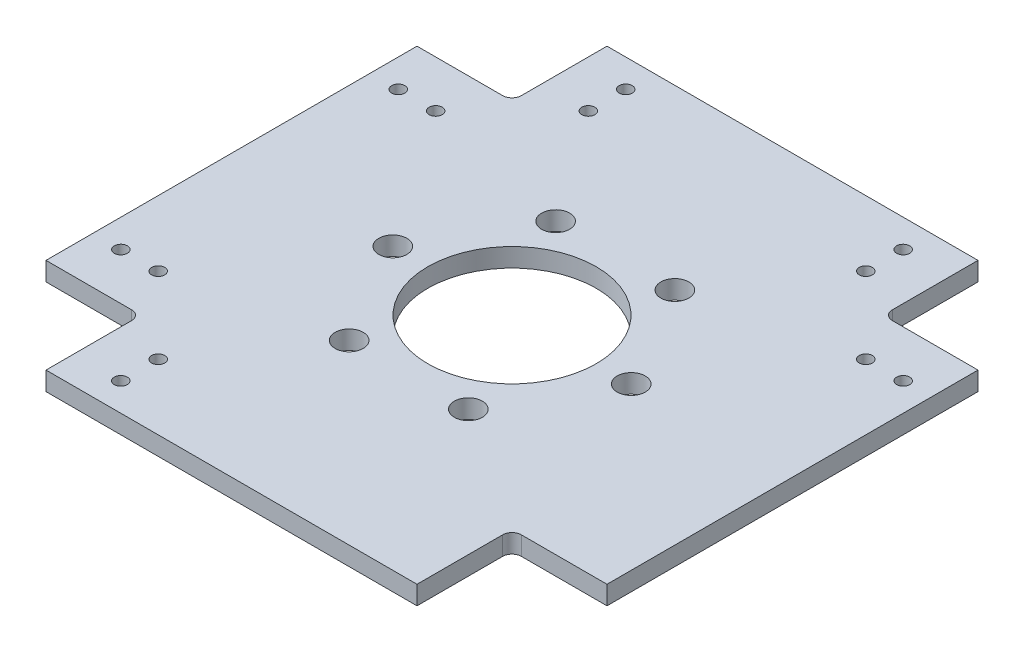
ISO-10303-21;
HEADER;
FILE_DESCRIPTION(('STEP AP214'),'2;1');
FILE_NAME('part.step','',(''),(''),'','','');
FILE_SCHEMA(('AUTOMOTIVE_DESIGN { 1 0 10303 214 1 1 1 1 }'));
ENDSEC;
DATA;
#1=APPLICATION_CONTEXT('core data for automotive mechanical design processes');
#2=APPLICATION_PROTOCOL_DEFINITION('international standard','automotive_design',2000,#1);
#3=PRODUCT_CONTEXT('',#1,'mechanical');
#4=PRODUCT('Part','Part','',(#3));
#5=PRODUCT_RELATED_PRODUCT_CATEGORY('part','',(#4));
#6=PRODUCT_DEFINITION_FORMATION('','',#4);
#7=PRODUCT_DEFINITION_CONTEXT('part definition',#1,'design');
#8=PRODUCT_DEFINITION('design','',#6,#7);
#9=PRODUCT_DEFINITION_SHAPE('','',#8);
#10=(LENGTH_UNIT() NAMED_UNIT(*) SI_UNIT(.MILLI.,.METRE.));
#11=(NAMED_UNIT(*) PLANE_ANGLE_UNIT() SI_UNIT($,.RADIAN.));
#12=(NAMED_UNIT(*) SI_UNIT($,.STERADIAN.) SOLID_ANGLE_UNIT());
#13=UNCERTAINTY_MEASURE_WITH_UNIT(LENGTH_MEASURE(1.E-05),#10,'distance_accuracy_value','');
#14=(GEOMETRIC_REPRESENTATION_CONTEXT(3) GLOBAL_UNCERTAINTY_ASSIGNED_CONTEXT((#13)) GLOBAL_UNIT_ASSIGNED_CONTEXT((#10,
#11,#12)) REPRESENTATION_CONTEXT('',''));
#15=CARTESIAN_POINT('',(0.,0.,0.));
#16=DIRECTION('',(0.,0.,1.));
#17=DIRECTION('',(1.,0.,0.));
#18=AXIS2_PLACEMENT_3D('',#15,#16,#17);
#19=CARTESIAN_POINT('',(0.,10.,0.));
#20=DIRECTION('',(0.,-1.,0.));
#21=DIRECTION('',(0.,0.,-1.));
#22=AXIS2_PLACEMENT_3D('',#19,#20,#21);
#23=PLANE('',#22);
#24=CARTESIAN_POINT('',(-63.75,10.,0.));
#25=DIRECTION('',(0.,-1.,0.));
#26=DIRECTION('',(0.,0.,-1.));
#27=AXIS2_PLACEMENT_3D('',#24,#25,#26);
#28=CIRCLE('',#27,7.49999999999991);
#29=CARTESIAN_POINT('',(-63.75,10.,-7.4999999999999));
#30=VERTEX_POINT('',#29);
#31=EDGE_CURVE('E795',#30,#30,#28,.T.);
#32=ORIENTED_EDGE('',*,*,#31,.T.);
#33=EDGE_LOOP('',(#32));
#34=FACE_BOUND('',#33,.T.);
#35=CARTESIAN_POINT('',(-31.8749999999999,10.,55.2091194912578));
#36=DIRECTION('',(0.,-1.,0.));
#37=DIRECTION('',(0.,0.,-1.));
#38=AXIS2_PLACEMENT_3D('',#35,#36,#37);
#39=CIRCLE('',#38,7.49999999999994);
#40=CARTESIAN_POINT('',(-31.8749999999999,10.,47.7091194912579));
#41=VERTEX_POINT('',#40);
#42=EDGE_CURVE('E921',#41,#41,#39,.T.);
#43=ORIENTED_EDGE('',*,*,#42,.T.);
#44=EDGE_LOOP('',(#43));
#45=FACE_BOUND('',#44,.T.);
#46=CARTESIAN_POINT('',(31.8750000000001,10.,55.2091194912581));
#47=DIRECTION('',(0.,-1.,0.));
#48=DIRECTION('',(0.,0.,-1.));
#49=AXIS2_PLACEMENT_3D('',#46,#47,#48);
#50=CIRCLE('',#49,7.50000000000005);
#51=CARTESIAN_POINT('',(31.8750000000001,10.,47.709119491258));
#52=VERTEX_POINT('',#51);
#53=EDGE_CURVE('E915',#52,#52,#50,.T.);
#54=ORIENTED_EDGE('',*,*,#53,.T.);
#55=EDGE_LOOP('',(#54));
#56=FACE_BOUND('',#55,.T.);
#57=CARTESIAN_POINT('',(63.7500000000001,10.,0.));
#58=DIRECTION('',(0.,-1.,0.));
#59=DIRECTION('',(0.,0.,-1.));
#60=AXIS2_PLACEMENT_3D('',#57,#58,#59);
#61=CIRCLE('',#60,7.5);
#62=CARTESIAN_POINT('',(63.7500000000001,10.,-7.50000000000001));
#63=VERTEX_POINT('',#62);
#64=EDGE_CURVE('E907',#63,#63,#61,.T.);
#65=ORIENTED_EDGE('',*,*,#64,.T.);
#66=EDGE_LOOP('',(#65));
#67=FACE_BOUND('',#66,.T.);
#68=CARTESIAN_POINT('',(31.875,10.,-55.2091194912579));
#69=DIRECTION('',(0.,-1.,0.));
#70=DIRECTION('',(0.,0.,-1.));
#71=AXIS2_PLACEMENT_3D('',#68,#69,#70);
#72=CIRCLE('',#71,7.50000000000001);
#73=CARTESIAN_POINT('',(31.875,10.,-62.7091194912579));
#74=VERTEX_POINT('',#73);
#75=EDGE_CURVE('E811',#74,#74,#72,.T.);
#76=ORIENTED_EDGE('',*,*,#75,.T.);
#77=EDGE_LOOP('',(#76));
#78=FACE_BOUND('',#77,.T.);
#79=CARTESIAN_POINT('',(-31.875,10.,-55.2091194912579));
#80=DIRECTION('',(0.,-1.,0.));
#81=DIRECTION('',(0.,0.,-1.));
#82=AXIS2_PLACEMENT_3D('',#79,#80,#81);
#83=CIRCLE('',#82,7.49999999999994);
#84=CARTESIAN_POINT('',(-31.875,10.,-62.7091194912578));
#85=VERTEX_POINT('',#84);
#86=EDGE_CURVE('E804',#85,#85,#83,.T.);
#87=ORIENTED_EDGE('',*,*,#86,.T.);
#88=EDGE_LOOP('',(#87));
#89=FACE_BOUND('',#88,.T.);
#90=CARTESIAN_POINT('',(74.1999999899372,10.,-135.000000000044));
#91=DIRECTION('',(0.,1.,0.));
#92=DIRECTION('',(0.,0.,1.));
#93=AXIS2_PLACEMENT_3D('',#90,#91,#92);
#94=CIRCLE('',#93,3.49999999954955);
#95=CARTESIAN_POINT('',(74.1999999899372,10.,-131.500000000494));
#96=VERTEX_POINT('',#95);
#97=EDGE_CURVE('E496',#96,#96,#94,.T.);
#98=ORIENTED_EDGE('',*,*,#97,.F.);
#99=EDGE_LOOP('',(#98));
#100=FACE_BOUND('',#99,.T.);
#101=CARTESIAN_POINT('',(-74.1999999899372,10.,135.000000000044));
#102=DIRECTION('',(0.,1.,0.));
#103=DIRECTION('',(0.,0.,1.));
#104=AXIS2_PLACEMENT_3D('',#101,#102,#103);
#105=CIRCLE('',#104,3.49999999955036);
#106=CARTESIAN_POINT('',(-74.1999999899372,10.,138.499999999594));
#107=VERTEX_POINT('',#106);
#108=EDGE_CURVE('E819',#107,#107,#105,.T.);
#109=ORIENTED_EDGE('',*,*,#108,.F.);
#110=EDGE_LOOP('',(#109));
#111=FACE_BOUND('',#110,.T.);
#112=CARTESIAN_POINT('',(-115.000000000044,10.,-74.1999999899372));
#113=DIRECTION('',(0.,1.,0.));
#114=DIRECTION('',(0.,0.,1.));
#115=AXIS2_PLACEMENT_3D('',#112,#113,#114);
#116=CIRCLE('',#115,3.49999999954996);
#117=CARTESIAN_POINT('',(-115.000000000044,10.,-70.6999999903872));
#118=VERTEX_POINT('',#117);
#119=EDGE_CURVE('E523',#118,#118,#116,.T.);
#120=ORIENTED_EDGE('',*,*,#119,.F.);
#121=EDGE_LOOP('',(#120));
#122=FACE_BOUND('',#121,.T.);
#123=CARTESIAN_POINT('',(74.1999999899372,10.,-115.000000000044));
#124=DIRECTION('',(0.,1.,0.));
#125=DIRECTION('',(0.,0.,1.));
#126=AXIS2_PLACEMENT_3D('',#123,#124,#125);
#127=CIRCLE('',#126,3.49999999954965);
#128=CARTESIAN_POINT('',(74.1999999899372,10.,-111.500000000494));
#129=VERTEX_POINT('',#128);
#130=EDGE_CURVE('E517',#129,#129,#127,.T.);
#131=ORIENTED_EDGE('',*,*,#130,.F.);
#132=EDGE_LOOP('',(#131));
#133=FACE_BOUND('',#132,.T.);
#134=CARTESIAN_POINT('',(-74.1999999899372,10.,115.000000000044));
#135=DIRECTION('',(0.,1.,0.));
#136=DIRECTION('',(0.,0.,1.));
#137=AXIS2_PLACEMENT_3D('',#134,#135,#136);
#138=CIRCLE('',#137,3.4999999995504);
#139=CARTESIAN_POINT('',(-74.1999999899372,10.,118.499999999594));
#140=VERTEX_POINT('',#139);
#141=EDGE_CURVE('E820',#140,#140,#138,.T.);
#142=ORIENTED_EDGE('',*,*,#141,.F.);
#143=EDGE_LOOP('',(#142));
#144=FACE_BOUND('',#143,.T.);
#145=CARTESIAN_POINT('',(-135.000000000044,10.,-74.1999999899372));
#146=DIRECTION('',(0.,1.,0.));
#147=DIRECTION('',(0.,0.,1.));
#148=AXIS2_PLACEMENT_3D('',#145,#146,#147);
#149=CIRCLE('',#148,3.49999999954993);
#150=CARTESIAN_POINT('',(-135.000000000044,10.,-70.6999999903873));
#151=VERTEX_POINT('',#150);
#152=EDGE_CURVE('E375',#151,#151,#149,.T.);
#153=ORIENTED_EDGE('',*,*,#152,.F.);
#154=EDGE_LOOP('',(#153));
#155=FACE_BOUND('',#154,.T.);
#156=DIRECTION('',(1.,0.,0.));
#157=VECTOR('',#156,1.);
#158=CARTESIAN_POINT('',(-150.,10.,99.2000000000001));
#159=LINE('',#158,#157);
#160=CARTESIAN_POINT('',(-150.,10.,99.2000000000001));
#161=VERTEX_POINT('',#160);
#162=CARTESIAN_POINT('',(-104.2,10.,99.2000000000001));
#163=VERTEX_POINT('',#162);
#164=EDGE_CURVE('E408',#161,#163,#159,.T.);
#165=ORIENTED_EDGE('',*,*,#164,.T.);
#166=CARTESIAN_POINT('',(-104.2,10.,104.2));
#167=DIRECTION('',(0.,-1.,0.));
#168=DIRECTION('',(0.,0.,-1.));
#169=AXIS2_PLACEMENT_3D('',#166,#167,#168);
#170=CIRCLE('',#169,5.);
#171=CARTESIAN_POINT('',(-99.2,10.,104.2));
#172=VERTEX_POINT('',#171);
#173=EDGE_CURVE('E164',#163,#172,#170,.T.);
#174=ORIENTED_EDGE('',*,*,#173,.T.);
#175=DIRECTION('',(0.,0.,1.));
#176=VECTOR('',#175,1.);
#177=CARTESIAN_POINT('',(-99.2,10.,150.));
#178=LINE('',#177,#176);
#179=CARTESIAN_POINT('',(-99.2,10.,150.));
#180=VERTEX_POINT('',#179);
#181=EDGE_CURVE('E156',#172,#180,#178,.T.);
#182=ORIENTED_EDGE('',*,*,#181,.T.);
#183=DIRECTION('',(1.,0.,0.));
#184=VECTOR('',#183,1.);
#185=CARTESIAN_POINT('',(-99.2,10.,150.));
#186=LINE('',#185,#184);
#187=CARTESIAN_POINT('',(99.2000000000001,10.,150.));
#188=VERTEX_POINT('',#187);
#189=EDGE_CURVE('E161',#180,#188,#186,.T.);
#190=ORIENTED_EDGE('',*,*,#189,.T.);
#191=DIRECTION('',(0.,0.,-1.));
#192=VECTOR('',#191,1.);
#193=CARTESIAN_POINT('',(99.2000000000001,10.,150.));
#194=LINE('',#193,#192);
#195=CARTESIAN_POINT('',(99.2,10.,104.2));
#196=VERTEX_POINT('',#195);
#197=EDGE_CURVE('E178',#188,#196,#194,.T.);
#198=ORIENTED_EDGE('',*,*,#197,.T.);
#199=CARTESIAN_POINT('',(104.2,10.,104.2));
#200=DIRECTION('',(0.,-1.,0.));
#201=DIRECTION('',(0.,0.,-1.));
#202=AXIS2_PLACEMENT_3D('',#199,#200,#201);
#203=CIRCLE('',#202,5.);
#204=CARTESIAN_POINT('',(104.2,10.,99.2000000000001));
#205=VERTEX_POINT('',#204);
#206=EDGE_CURVE('E212',#196,#205,#203,.T.);
#207=ORIENTED_EDGE('',*,*,#206,.T.);
#208=DIRECTION('',(1.,0.,0.));
#209=VECTOR('',#208,1.);
#210=CARTESIAN_POINT('',(150.,10.,99.2000000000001));
#211=LINE('',#210,#209);
#212=CARTESIAN_POINT('',(150.,10.,99.2000000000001));
#213=VERTEX_POINT('',#212);
#214=EDGE_CURVE('E391',#205,#213,#211,.T.);
#215=ORIENTED_EDGE('',*,*,#214,.T.);
#216=DIRECTION('',(0.,0.,-1.));
#217=VECTOR('',#216,1.);
#218=CARTESIAN_POINT('',(150.,10.,99.2000000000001));
#219=LINE('',#218,#217);
#220=CARTESIAN_POINT('',(150.,10.,-99.1999999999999));
#221=VERTEX_POINT('',#220);
#222=EDGE_CURVE('E393',#213,#221,#219,.T.);
#223=ORIENTED_EDGE('',*,*,#222,.T.);
#224=DIRECTION('',(-1.,0.,0.));
#225=VECTOR('',#224,1.);
#226=CARTESIAN_POINT('',(150.,10.,-99.1999999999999));
#227=LINE('',#226,#225);
#228=CARTESIAN_POINT('',(104.2,10.,-99.2));
#229=VERTEX_POINT('',#228);
#230=EDGE_CURVE('E395',#221,#229,#227,.T.);
#231=ORIENTED_EDGE('',*,*,#230,.T.);
#232=CARTESIAN_POINT('',(104.2,10.,-104.2));
#233=DIRECTION('',(0.,-1.,0.));
#234=DIRECTION('',(0.,0.,-1.));
#235=AXIS2_PLACEMENT_3D('',#232,#233,#234);
#236=CIRCLE('',#235,5.);
#237=CARTESIAN_POINT('',(99.2,10.,-104.2));
#238=VERTEX_POINT('',#237);
#239=EDGE_CURVE('E216',#229,#238,#236,.T.);
#240=ORIENTED_EDGE('',*,*,#239,.T.);
#241=DIRECTION('',(0.,0.,-1.));
#242=VECTOR('',#241,1.);
#243=CARTESIAN_POINT('',(99.2,10.,-150.));
#244=LINE('',#243,#242);
#245=CARTESIAN_POINT('',(99.2,10.,-150.));
#246=VERTEX_POINT('',#245);
#247=EDGE_CURVE('E398',#238,#246,#244,.T.);
#248=ORIENTED_EDGE('',*,*,#247,.T.);
#249=DIRECTION('',(-1.,0.,0.));
#250=VECTOR('',#249,1.);
#251=CARTESIAN_POINT('',(-99.2000000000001,10.,-150.));
#252=LINE('',#251,#250);
#253=CARTESIAN_POINT('',(-99.2000000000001,10.,-150.));
#254=VERTEX_POINT('',#253);
#255=EDGE_CURVE('E400',#246,#254,#252,.T.);
#256=ORIENTED_EDGE('',*,*,#255,.T.);
#257=DIRECTION('',(0.,0.,1.));
#258=VECTOR('',#257,1.);
#259=CARTESIAN_POINT('',(-99.2000000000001,10.,-150.));
#260=LINE('',#259,#258);
#261=CARTESIAN_POINT('',(-99.2,10.,-104.2));
#262=VERTEX_POINT('',#261);
#263=EDGE_CURVE('E402',#254,#262,#260,.T.);
#264=ORIENTED_EDGE('',*,*,#263,.T.);
#265=CARTESIAN_POINT('',(-104.2,10.,-104.2));
#266=DIRECTION('',(0.,-1.,0.));
#267=DIRECTION('',(0.,0.,-1.));
#268=AXIS2_PLACEMENT_3D('',#265,#266,#267);
#269=CIRCLE('',#268,5.);
#270=CARTESIAN_POINT('',(-104.2,10.,-99.2));
#271=VERTEX_POINT('',#270);
#272=EDGE_CURVE('E219',#262,#271,#269,.T.);
#273=ORIENTED_EDGE('',*,*,#272,.T.);
#274=DIRECTION('',(-1.,0.,0.));
#275=VECTOR('',#274,1.);
#276=CARTESIAN_POINT('',(-150.,10.,-99.2));
#277=LINE('',#276,#275);
#278=CARTESIAN_POINT('',(-150.,10.,-99.2));
#279=VERTEX_POINT('',#278);
#280=EDGE_CURVE('E404',#271,#279,#277,.T.);
#281=ORIENTED_EDGE('',*,*,#280,.T.);
#282=DIRECTION('',(0.,0.,1.));
#283=VECTOR('',#282,1.);
#284=CARTESIAN_POINT('',(-150.,10.,99.2000000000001));
#285=LINE('',#284,#283);
#286=EDGE_CURVE('E406',#279,#161,#285,.T.);
#287=ORIENTED_EDGE('',*,*,#286,.T.);
#288=EDGE_LOOP('',(#165,#174,#182,#190,#198,#207,#215,#223,#231,#240,#248,#256,#264,#273,#281,#287));
#289=FACE_BOUND('',#288,.T.);
#290=CARTESIAN_POINT('',(0.,10.,0.));
#291=DIRECTION('',(0.,1.,0.));
#292=DIRECTION('',(0.,0.,1.));
#293=AXIS2_PLACEMENT_3D('',#290,#291,#292);
#294=CIRCLE('',#293,45.);
#295=CARTESIAN_POINT('',(0.,10.,45.));
#296=VERTEX_POINT('',#295);
#297=EDGE_CURVE('E385',#296,#296,#294,.T.);
#298=ORIENTED_EDGE('',*,*,#297,.F.);
#299=EDGE_LOOP('',(#298));
#300=FACE_BOUND('',#299,.T.);
#301=CARTESIAN_POINT('',(-134.999999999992,10.,74.1999999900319));
#302=DIRECTION('',(0.,1.,0.));
#303=DIRECTION('',(0.,0.,1.));
#304=AXIS2_PLACEMENT_3D('',#301,#302,#303);
#305=CIRCLE('',#304,3.50000000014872);
#306=CARTESIAN_POINT('',(-134.999999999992,10.,77.6999999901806));
#307=VERTEX_POINT('',#306);
#308=EDGE_CURVE('E813',#307,#307,#305,.F.);
#309=ORIENTED_EDGE('',*,*,#308,.T.);
#310=EDGE_LOOP('',(#309));
#311=FACE_BOUND('',#310,.T.);
#312=CARTESIAN_POINT('',(-114.999999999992,10.,74.1999999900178));
#313=DIRECTION('',(0.,1.,0.));
#314=DIRECTION('',(0.,0.,1.));
#315=AXIS2_PLACEMENT_3D('',#312,#313,#314);
#316=CIRCLE('',#315,3.50000000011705);
#317=CARTESIAN_POINT('',(-114.999999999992,10.,77.6999999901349));
#318=VERTEX_POINT('',#317);
#319=EDGE_CURVE('E807',#318,#318,#316,.F.);
#320=ORIENTED_EDGE('',*,*,#319,.T.);
#321=EDGE_LOOP('',(#320));
#322=FACE_BOUND('',#321,.T.);
#323=CARTESIAN_POINT('',(-74.1999999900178,10.,-114.999999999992));
#324=DIRECTION('',(0.,1.,0.));
#325=DIRECTION('',(0.,0.,1.));
#326=AXIS2_PLACEMENT_3D('',#323,#324,#325);
#327=CIRCLE('',#326,3.50000000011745);
#328=CARTESIAN_POINT('',(-74.1999999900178,10.,-111.499999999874));
#329=VERTEX_POINT('',#328);
#330=EDGE_CURVE('E511',#329,#329,#327,.F.);
#331=ORIENTED_EDGE('',*,*,#330,.T.);
#332=EDGE_LOOP('',(#331));
#333=FACE_BOUND('',#332,.T.);
#334=CARTESIAN_POINT('',(-74.1999999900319,10.,-134.999999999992));
#335=DIRECTION('',(0.,1.,0.));
#336=DIRECTION('',(0.,0.,1.));
#337=AXIS2_PLACEMENT_3D('',#334,#335,#336);
#338=CIRCLE('',#337,3.50000000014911);
#339=CARTESIAN_POINT('',(-74.1999999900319,10.,-131.499999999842));
#340=VERTEX_POINT('',#339);
#341=EDGE_CURVE('E510',#340,#340,#338,.F.);
#342=ORIENTED_EDGE('',*,*,#341,.T.);
#343=EDGE_LOOP('',(#342));
#344=FACE_BOUND('',#343,.T.);
#345=CARTESIAN_POINT('',(134.999999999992,10.,-74.1999999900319));
#346=DIRECTION('',(0.,1.,0.));
#347=DIRECTION('',(0.,0.,1.));
#348=AXIS2_PLACEMENT_3D('',#345,#346,#347);
#349=CIRCLE('',#348,3.50000000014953);
#350=CARTESIAN_POINT('',(134.999999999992,10.,-70.6999999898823));
#351=VERTEX_POINT('',#350);
#352=EDGE_CURVE('E830',#351,#351,#349,.F.);
#353=ORIENTED_EDGE('',*,*,#352,.T.);
#354=EDGE_LOOP('',(#353));
#355=FACE_BOUND('',#354,.T.);
#356=CARTESIAN_POINT('',(114.999999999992,10.,-74.1999999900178));
#357=DIRECTION('',(0.,1.,0.));
#358=DIRECTION('',(0.,0.,1.));
#359=AXIS2_PLACEMENT_3D('',#356,#357,#358);
#360=CIRCLE('',#359,3.50000000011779);
#361=CARTESIAN_POINT('',(114.999999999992,10.,-70.6999999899));
#362=VERTEX_POINT('',#361);
#363=EDGE_CURVE('E497',#362,#362,#360,.F.);
#364=ORIENTED_EDGE('',*,*,#363,.T.);
#365=EDGE_LOOP('',(#364));
#366=FACE_BOUND('',#365,.T.);
#367=ADVANCED_FACE('F41',(#34,#45,#56,#67,#78,#89,#100,#111,#122,#133,#144,#155,#289,#300,#311,
#322,#333,#344,#355,#366),#23,.F.);
#368=CARTESIAN_POINT('',(0.,0.,0.));
#369=DIRECTION('',(0.,-1.,0.));
#370=DIRECTION('',(0.,0.,-1.));
#371=AXIS2_PLACEMENT_3D('',#368,#369,#370);
#372=PLANE('',#371);
#373=CARTESIAN_POINT('',(-63.75,0.,0.));
#374=DIRECTION('',(0.,-1.,0.));
#375=DIRECTION('',(0.,0.,-1.));
#376=AXIS2_PLACEMENT_3D('',#373,#374,#375);
#377=CIRCLE('',#376,7.49999999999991);
#378=CARTESIAN_POINT('',(-63.75,0.,-7.4999999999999));
#379=VERTEX_POINT('',#378);
#380=EDGE_CURVE('E798',#379,#379,#377,.T.);
#381=ORIENTED_EDGE('',*,*,#380,.F.);
#382=EDGE_LOOP('',(#381));
#383=FACE_BOUND('',#382,.T.);
#384=CARTESIAN_POINT('',(-31.8749999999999,0.,55.2091194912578));
#385=DIRECTION('',(0.,-1.,0.));
#386=DIRECTION('',(0.,0.,-1.));
#387=AXIS2_PLACEMENT_3D('',#384,#385,#386);
#388=CIRCLE('',#387,7.49999999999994);
#389=CARTESIAN_POINT('',(-31.8749999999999,0.,47.7091194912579));
#390=VERTEX_POINT('',#389);
#391=EDGE_CURVE('E800',#390,#390,#388,.T.);
#392=ORIENTED_EDGE('',*,*,#391,.F.);
#393=EDGE_LOOP('',(#392));
#394=FACE_BOUND('',#393,.T.);
#395=CARTESIAN_POINT('',(31.8750000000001,0.,55.2091194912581));
#396=DIRECTION('',(0.,-1.,0.));
#397=DIRECTION('',(0.,0.,-1.));
#398=AXIS2_PLACEMENT_3D('',#395,#396,#397);
#399=CIRCLE('',#398,7.50000000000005);
#400=CARTESIAN_POINT('',(31.8750000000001,0.,47.709119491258));
#401=VERTEX_POINT('',#400);
#402=EDGE_CURVE('E918',#401,#401,#399,.T.);
#403=ORIENTED_EDGE('',*,*,#402,.F.);
#404=EDGE_LOOP('',(#403));
#405=FACE_BOUND('',#404,.T.);
#406=CARTESIAN_POINT('',(63.7500000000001,0.,0.));
#407=DIRECTION('',(0.,-1.,0.));
#408=DIRECTION('',(0.,0.,-1.));
#409=AXIS2_PLACEMENT_3D('',#406,#407,#408);
#410=CIRCLE('',#409,7.5);
#411=CARTESIAN_POINT('',(63.7500000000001,0.,-7.50000000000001));
#412=VERTEX_POINT('',#411);
#413=EDGE_CURVE('E912',#412,#412,#410,.T.);
#414=ORIENTED_EDGE('',*,*,#413,.F.);
#415=EDGE_LOOP('',(#414));
#416=FACE_BOUND('',#415,.T.);
#417=CARTESIAN_POINT('',(31.875,0.,-55.2091194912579));
#418=DIRECTION('',(0.,-1.,0.));
#419=DIRECTION('',(0.,0.,-1.));
#420=AXIS2_PLACEMENT_3D('',#417,#418,#419);
#421=CIRCLE('',#420,7.50000000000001);
#422=CARTESIAN_POINT('',(31.875,0.,-62.7091194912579));
#423=VERTEX_POINT('',#422);
#424=EDGE_CURVE('E902',#423,#423,#421,.T.);
#425=ORIENTED_EDGE('',*,*,#424,.F.);
#426=EDGE_LOOP('',(#425));
#427=FACE_BOUND('',#426,.T.);
#428=CARTESIAN_POINT('',(-31.875,0.,-55.2091194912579));
#429=DIRECTION('',(0.,-1.,0.));
#430=DIRECTION('',(0.,0.,-1.));
#431=AXIS2_PLACEMENT_3D('',#428,#429,#430);
#432=CIRCLE('',#431,7.49999999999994);
#433=CARTESIAN_POINT('',(-31.875,0.,-62.7091194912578));
#434=VERTEX_POINT('',#433);
#435=EDGE_CURVE('E808',#434,#434,#432,.T.);
#436=ORIENTED_EDGE('',*,*,#435,.F.);
#437=EDGE_LOOP('',(#436));
#438=FACE_BOUND('',#437,.T.);
#439=CARTESIAN_POINT('',(74.1999999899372,0.,-135.000000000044));
#440=DIRECTION('',(0.,1.,0.));
#441=DIRECTION('',(0.,0.,1.));
#442=AXIS2_PLACEMENT_3D('',#439,#440,#441);
#443=CIRCLE('',#442,3.49999999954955);
#444=CARTESIAN_POINT('',(74.1999999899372,0.,-131.500000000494));
#445=VERTEX_POINT('',#444);
#446=EDGE_CURVE('E500',#445,#445,#443,.T.);
#447=ORIENTED_EDGE('',*,*,#446,.T.);
#448=EDGE_LOOP('',(#447));
#449=FACE_BOUND('',#448,.T.);
#450=CARTESIAN_POINT('',(134.999999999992,0.,-74.1999999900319));
#451=DIRECTION('',(0.,1.,0.));
#452=DIRECTION('',(0.,0.,1.));
#453=AXIS2_PLACEMENT_3D('',#450,#451,#452);
#454=CIRCLE('',#453,3.50000000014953);
#455=CARTESIAN_POINT('',(134.999999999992,0.,-70.6999999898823));
#456=VERTEX_POINT('',#455);
#457=EDGE_CURVE('E503',#456,#456,#454,.F.);
#458=ORIENTED_EDGE('',*,*,#457,.F.);
#459=EDGE_LOOP('',(#458));
#460=FACE_BOUND('',#459,.T.);
#461=CARTESIAN_POINT('',(-74.1999999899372,0.,135.000000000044));
#462=DIRECTION('',(0.,1.,0.));
#463=DIRECTION('',(0.,0.,1.));
#464=AXIS2_PLACEMENT_3D('',#461,#462,#463);
#465=CIRCLE('',#464,3.49999999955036);
#466=CARTESIAN_POINT('',(-74.1999999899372,0.,138.499999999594));
#467=VERTEX_POINT('',#466);
#468=EDGE_CURVE('E833',#467,#467,#465,.T.);
#469=ORIENTED_EDGE('',*,*,#468,.T.);
#470=EDGE_LOOP('',(#469));
#471=FACE_BOUND('',#470,.T.);
#472=CARTESIAN_POINT('',(-115.000000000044,0.,-74.1999999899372));
#473=DIRECTION('',(0.,1.,0.));
#474=DIRECTION('',(0.,0.,1.));
#475=AXIS2_PLACEMENT_3D('',#472,#473,#474);
#476=CIRCLE('',#475,3.49999999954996);
#477=CARTESIAN_POINT('',(-115.000000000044,0.,-70.6999999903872));
#478=VERTEX_POINT('',#477);
#479=EDGE_CURVE('E520',#478,#478,#476,.T.);
#480=ORIENTED_EDGE('',*,*,#479,.T.);
#481=EDGE_LOOP('',(#480));
#482=FACE_BOUND('',#481,.T.);
#483=CARTESIAN_POINT('',(-74.1999999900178,0.,-114.999999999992));
#484=DIRECTION('',(0.,1.,0.));
#485=DIRECTION('',(0.,0.,1.));
#486=AXIS2_PLACEMENT_3D('',#483,#484,#485);
#487=CIRCLE('',#486,3.50000000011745);
#488=CARTESIAN_POINT('',(-74.1999999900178,0.,-111.499999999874));
#489=VERTEX_POINT('',#488);
#490=EDGE_CURVE('E507',#489,#489,#487,.F.);
#491=ORIENTED_EDGE('',*,*,#490,.F.);
#492=EDGE_LOOP('',(#491));
#493=FACE_BOUND('',#492,.T.);
#494=CARTESIAN_POINT('',(74.1999999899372,0.,-115.000000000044));
#495=DIRECTION('',(0.,1.,0.));
#496=DIRECTION('',(0.,0.,1.));
#497=AXIS2_PLACEMENT_3D('',#494,#495,#496);
#498=CIRCLE('',#497,3.49999999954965);
#499=CARTESIAN_POINT('',(74.1999999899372,0.,-111.500000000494));
#500=VERTEX_POINT('',#499);
#501=EDGE_CURVE('E514',#500,#500,#498,.T.);
#502=ORIENTED_EDGE('',*,*,#501,.T.);
#503=EDGE_LOOP('',(#502));
#504=FACE_BOUND('',#503,.T.);
#505=CARTESIAN_POINT('',(-134.999999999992,0.,74.1999999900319));
#506=DIRECTION('',(0.,1.,0.));
#507=DIRECTION('',(0.,0.,1.));
#508=AXIS2_PLACEMENT_3D('',#505,#506,#507);
#509=CIRCLE('',#508,3.50000000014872);
#510=CARTESIAN_POINT('',(-134.999999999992,0.,77.6999999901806));
#511=VERTEX_POINT('',#510);
#512=EDGE_CURVE('E823',#511,#511,#509,.F.);
#513=ORIENTED_EDGE('',*,*,#512,.F.);
#514=EDGE_LOOP('',(#513));
#515=FACE_BOUND('',#514,.T.);
#516=CARTESIAN_POINT('',(-74.1999999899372,0.,115.000000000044));
#517=DIRECTION('',(0.,1.,0.));
#518=DIRECTION('',(0.,0.,1.));
#519=AXIS2_PLACEMENT_3D('',#516,#517,#518);
#520=CIRCLE('',#519,3.4999999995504);
#521=CARTESIAN_POINT('',(-74.1999999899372,0.,118.499999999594));
#522=VERTEX_POINT('',#521);
#523=EDGE_CURVE('E816',#522,#522,#520,.T.);
#524=ORIENTED_EDGE('',*,*,#523,.T.);
#525=EDGE_LOOP('',(#524));
#526=FACE_BOUND('',#525,.T.);
#527=CARTESIAN_POINT('',(-135.000000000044,0.,-74.1999999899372));
#528=DIRECTION('',(0.,1.,0.));
#529=DIRECTION('',(0.,0.,1.));
#530=AXIS2_PLACEMENT_3D('',#527,#528,#529);
#531=CIRCLE('',#530,3.49999999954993);
#532=CARTESIAN_POINT('',(-135.000000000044,0.,-70.6999999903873));
#533=VERTEX_POINT('',#532);
#534=EDGE_CURVE('E369',#533,#533,#531,.T.);
#535=ORIENTED_EDGE('',*,*,#534,.T.);
#536=EDGE_LOOP('',(#535));
#537=FACE_BOUND('',#536,.T.);
#538=CARTESIAN_POINT('',(-40.1279204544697,0.,80.0000000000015));
#539=DIRECTION('',(0.,-1.,0.));
#540=DIRECTION('',(0.,0.,-1.));
#541=AXIS2_PLACEMENT_3D('',#538,#539,#540);
#542=CIRCLE('',#541,7.35000000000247);
#543=CARTESIAN_POINT('',(-40.1279204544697,0.,72.6499999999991));
#544=VERTEX_POINT('',#543);
#545=EDGE_CURVE('E233',#544,#544,#542,.F.);
#546=ORIENTED_EDGE('',*,*,#545,.T.);
#547=EDGE_LOOP('',(#546));
#548=FACE_BOUND('',#547,.T.);
#549=CARTESIAN_POINT('',(40.1279204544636,0.,80.0000000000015));
#550=DIRECTION('',(0.,-1.,0.));
#551=DIRECTION('',(0.,0.,-1.));
#552=AXIS2_PLACEMENT_3D('',#549,#550,#551);
#553=CIRCLE('',#552,7.35000000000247);
#554=CARTESIAN_POINT('',(40.1279204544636,0.,72.6499999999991));
#555=VERTEX_POINT('',#554);
#556=EDGE_CURVE('E230',#555,#555,#553,.F.);
#557=ORIENTED_EDGE('',*,*,#556,.T.);
#558=EDGE_LOOP('',(#557));
#559=FACE_BOUND('',#558,.T.);
#560=CARTESIAN_POINT('',(-40.1279204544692,0.,-79.9999999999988));
#561=DIRECTION('',(0.,-1.,0.));
#562=DIRECTION('',(0.,0.,-1.));
#563=AXIS2_PLACEMENT_3D('',#560,#561,#562);
#564=CIRCLE('',#563,7.35000000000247);
#565=CARTESIAN_POINT('',(-40.1279204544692,0.,-87.3500000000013));
#566=VERTEX_POINT('',#565);
#567=EDGE_CURVE('E227',#566,#566,#564,.F.);
#568=ORIENTED_EDGE('',*,*,#567,.T.);
#569=EDGE_LOOP('',(#568));
#570=FACE_BOUND('',#569,.T.);
#571=CARTESIAN_POINT('',(40.1279204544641,0.,-79.9999999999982));
#572=DIRECTION('',(0.,-1.,0.));
#573=DIRECTION('',(0.,0.,-1.));
#574=AXIS2_PLACEMENT_3D('',#571,#572,#573);
#575=CIRCLE('',#574,7.35000000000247);
#576=CARTESIAN_POINT('',(40.1279204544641,0.,-87.3500000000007));
#577=VERTEX_POINT('',#576);
#578=EDGE_CURVE('E224',#577,#577,#575,.F.);
#579=ORIENTED_EDGE('',*,*,#578,.T.);
#580=EDGE_LOOP('',(#579));
#581=FACE_BOUND('',#580,.T.);
#582=DIRECTION('',(0.,0.,1.));
#583=VECTOR('',#582,1.);
#584=CARTESIAN_POINT('',(-99.2,0.,150.));
#585=LINE('',#584,#583);
#586=CARTESIAN_POINT('',(-99.2,0.,104.2));
#587=VERTEX_POINT('',#586);
#588=CARTESIAN_POINT('',(-99.2,0.,150.));
#589=VERTEX_POINT('',#588);
#590=EDGE_CURVE('E182',#587,#589,#585,.T.);
#591=ORIENTED_EDGE('',*,*,#590,.F.);
#592=CARTESIAN_POINT('',(-104.2,0.,104.2));
#593=DIRECTION('',(0.,-1.,0.));
#594=DIRECTION('',(0.,0.,-1.));
#595=AXIS2_PLACEMENT_3D('',#592,#593,#594);
#596=CIRCLE('',#595,5.);
#597=CARTESIAN_POINT('',(-104.2,0.,99.2000000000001));
#598=VERTEX_POINT('',#597);
#599=EDGE_CURVE('E207',#587,#598,#596,.F.);
#600=ORIENTED_EDGE('',*,*,#599,.T.);
#601=DIRECTION('',(1.,0.,0.));
#602=VECTOR('',#601,1.);
#603=CARTESIAN_POINT('',(-150.,0.,99.2000000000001));
#604=LINE('',#603,#602);
#605=CARTESIAN_POINT('',(-150.,0.,99.2000000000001));
#606=VERTEX_POINT('',#605);
#607=EDGE_CURVE('E169',#606,#598,#604,.T.);
#608=ORIENTED_EDGE('',*,*,#607,.F.);
#609=DIRECTION('',(0.,0.,1.));
#610=VECTOR('',#609,1.);
#611=CARTESIAN_POINT('',(-150.,0.,99.2000000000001));
#612=LINE('',#611,#610);
#613=CARTESIAN_POINT('',(-150.,0.,-99.2));
#614=VERTEX_POINT('',#613);
#615=EDGE_CURVE('E432',#614,#606,#612,.T.);
#616=ORIENTED_EDGE('',*,*,#615,.F.);
#617=DIRECTION('',(-1.,0.,0.));
#618=VECTOR('',#617,1.);
#619=CARTESIAN_POINT('',(-150.,0.,-99.2));
#620=LINE('',#619,#618);
#621=CARTESIAN_POINT('',(-104.2,0.,-99.2));
#622=VERTEX_POINT('',#621);
#623=EDGE_CURVE('E430',#622,#614,#620,.T.);
#624=ORIENTED_EDGE('',*,*,#623,.F.);
#625=CARTESIAN_POINT('',(-104.2,0.,-104.2));
#626=DIRECTION('',(0.,-1.,0.));
#627=DIRECTION('',(0.,0.,-1.));
#628=AXIS2_PLACEMENT_3D('',#625,#626,#627);
#629=CIRCLE('',#628,5.);
#630=CARTESIAN_POINT('',(-99.2,0.,-104.2));
#631=VERTEX_POINT('',#630);
#632=EDGE_CURVE('E65',#622,#631,#629,.F.);
#633=ORIENTED_EDGE('',*,*,#632,.T.);
#634=DIRECTION('',(0.,0.,1.));
#635=VECTOR('',#634,1.);
#636=CARTESIAN_POINT('',(-99.2000000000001,0.,-150.));
#637=LINE('',#636,#635);
#638=CARTESIAN_POINT('',(-99.2000000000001,0.,-150.));
#639=VERTEX_POINT('',#638);
#640=EDGE_CURVE('E428',#639,#631,#637,.T.);
#641=ORIENTED_EDGE('',*,*,#640,.F.);
#642=DIRECTION('',(-1.,0.,0.));
#643=VECTOR('',#642,1.);
#644=CARTESIAN_POINT('',(-99.2000000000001,0.,-150.));
#645=LINE('',#644,#643);
#646=CARTESIAN_POINT('',(99.2,0.,-150.));
#647=VERTEX_POINT('',#646);
#648=EDGE_CURVE('E426',#647,#639,#645,.T.);
#649=ORIENTED_EDGE('',*,*,#648,.F.);
#650=DIRECTION('',(0.,0.,-1.));
#651=VECTOR('',#650,1.);
#652=CARTESIAN_POINT('',(99.2,0.,-150.));
#653=LINE('',#652,#651);
#654=CARTESIAN_POINT('',(99.2,0.,-104.2));
#655=VERTEX_POINT('',#654);
#656=EDGE_CURVE('E424',#655,#647,#653,.T.);
#657=ORIENTED_EDGE('',*,*,#656,.F.);
#658=CARTESIAN_POINT('',(104.2,0.,-104.2));
#659=DIRECTION('',(0.,-1.,0.));
#660=DIRECTION('',(0.,0.,-1.));
#661=AXIS2_PLACEMENT_3D('',#658,#659,#660);
#662=CIRCLE('',#661,5.);
#663=CARTESIAN_POINT('',(104.2,0.,-99.2));
#664=VERTEX_POINT('',#663);
#665=EDGE_CURVE('E214',#655,#664,#662,.F.);
#666=ORIENTED_EDGE('',*,*,#665,.T.);
#667=DIRECTION('',(-1.,0.,0.));
#668=VECTOR('',#667,1.);
#669=CARTESIAN_POINT('',(150.,0.,-99.1999999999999));
#670=LINE('',#669,#668);
#671=CARTESIAN_POINT('',(150.,0.,-99.1999999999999));
#672=VERTEX_POINT('',#671);
#673=EDGE_CURVE('E421',#672,#664,#670,.T.);
#674=ORIENTED_EDGE('',*,*,#673,.F.);
#675=DIRECTION('',(0.,0.,-1.));
#676=VECTOR('',#675,1.);
#677=CARTESIAN_POINT('',(150.,0.,99.2000000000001));
#678=LINE('',#677,#676);
#679=CARTESIAN_POINT('',(150.,0.,99.2000000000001));
#680=VERTEX_POINT('',#679);
#681=EDGE_CURVE('E419',#680,#672,#678,.T.);
#682=ORIENTED_EDGE('',*,*,#681,.F.);
#683=DIRECTION('',(1.,0.,0.));
#684=VECTOR('',#683,1.);
#685=CARTESIAN_POINT('',(150.,0.,99.2000000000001));
#686=LINE('',#685,#684);
#687=CARTESIAN_POINT('',(104.2,0.,99.2000000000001));
#688=VERTEX_POINT('',#687);
#689=EDGE_CURVE('E417',#688,#680,#686,.T.);
#690=ORIENTED_EDGE('',*,*,#689,.F.);
#691=CARTESIAN_POINT('',(104.2,0.,104.2));
#692=DIRECTION('',(0.,-1.,0.));
#693=DIRECTION('',(0.,0.,-1.));
#694=AXIS2_PLACEMENT_3D('',#691,#692,#693);
#695=CIRCLE('',#694,5.);
#696=CARTESIAN_POINT('',(99.2,0.,104.2));
#697=VERTEX_POINT('',#696);
#698=EDGE_CURVE('E210',#688,#697,#695,.F.);
#699=ORIENTED_EDGE('',*,*,#698,.T.);
#700=DIRECTION('',(0.,0.,-1.));
#701=VECTOR('',#700,1.);
#702=CARTESIAN_POINT('',(99.2000000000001,0.,150.));
#703=LINE('',#702,#701);
#704=CARTESIAN_POINT('',(99.2000000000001,0.,150.));
#705=VERTEX_POINT('',#704);
#706=EDGE_CURVE('E414',#705,#697,#703,.T.);
#707=ORIENTED_EDGE('',*,*,#706,.F.);
#708=DIRECTION('',(1.,0.,0.));
#709=VECTOR('',#708,1.);
#710=CARTESIAN_POINT('',(-99.2,0.,150.));
#711=LINE('',#710,#709);
#712=EDGE_CURVE('E412',#589,#705,#711,.T.);
#713=ORIENTED_EDGE('',*,*,#712,.F.);
#714=EDGE_LOOP('',(#591,#600,#608,#616,#624,#633,#641,#649,#657,#666,#674,#682,#690,#699,#707,#713));
#715=FACE_BOUND('',#714,.T.);
#716=CARTESIAN_POINT('',(0.,0.,0.));
#717=DIRECTION('',(0.,1.,0.));
#718=DIRECTION('',(0.,0.,1.));
#719=AXIS2_PLACEMENT_3D('',#716,#717,#718);
#720=CIRCLE('',#719,45.);
#721=CARTESIAN_POINT('',(0.,0.,45.));
#722=VERTEX_POINT('',#721);
#723=EDGE_CURVE('E384',#722,#722,#720,.T.);
#724=ORIENTED_EDGE('',*,*,#723,.T.);
#725=EDGE_LOOP('',(#724));
#726=FACE_BOUND('',#725,.T.);
#727=CARTESIAN_POINT('',(-114.999999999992,0.,74.1999999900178));
#728=DIRECTION('',(0.,1.,0.));
#729=DIRECTION('',(0.,0.,1.));
#730=AXIS2_PLACEMENT_3D('',#727,#728,#729);
#731=CIRCLE('',#730,3.50000000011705);
#732=CARTESIAN_POINT('',(-114.999999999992,0.,77.6999999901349));
#733=VERTEX_POINT('',#732);
#734=EDGE_CURVE('E487',#733,#733,#731,.F.);
#735=ORIENTED_EDGE('',*,*,#734,.F.);
#736=EDGE_LOOP('',(#735));
#737=FACE_BOUND('',#736,.T.);
#738=CARTESIAN_POINT('',(-74.1999999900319,0.,-134.999999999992));
#739=DIRECTION('',(0.,1.,0.));
#740=DIRECTION('',(0.,0.,1.));
#741=AXIS2_PLACEMENT_3D('',#738,#739,#740);
#742=CIRCLE('',#741,3.50000000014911);
#743=CARTESIAN_POINT('',(-74.1999999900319,0.,-131.499999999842));
#744=VERTEX_POINT('',#743);
#745=EDGE_CURVE('E491',#744,#744,#742,.F.);
#746=ORIENTED_EDGE('',*,*,#745,.F.);
#747=EDGE_LOOP('',(#746));
#748=FACE_BOUND('',#747,.T.);
#749=CARTESIAN_POINT('',(114.999999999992,0.,-74.1999999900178));
#750=DIRECTION('',(0.,1.,0.));
#751=DIRECTION('',(0.,0.,1.));
#752=AXIS2_PLACEMENT_3D('',#749,#750,#751);
#753=CIRCLE('',#752,3.50000000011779);
#754=CARTESIAN_POINT('',(114.999999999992,0.,-70.6999999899));
#755=VERTEX_POINT('',#754);
#756=EDGE_CURVE('E494',#755,#755,#753,.F.);
#757=ORIENTED_EDGE('',*,*,#756,.F.);
#758=EDGE_LOOP('',(#757));
#759=FACE_BOUND('',#758,.T.);
#760=ADVANCED_FACE('F260',(#383,#394,#405,#416,#427,#438,#449,#460,#471,#482,#493,#504,#515,
#526,#537,#548,#559,#570,#581,#715,#726,#737,#748,#759),#372,.T.);
#761=CARTESIAN_POINT('',(-99.2,10.,150.));
#762=DIRECTION('',(1.,0.,0.));
#763=DIRECTION('',(0.,0.,-1.));
#764=AXIS2_PLACEMENT_3D('',#761,#762,#763);
#765=PLANE('',#764);
#766=ORIENTED_EDGE('',*,*,#181,.F.);
#767=DIRECTION('',(0.,-1.,0.));
#768=VECTOR('',#767,1.);
#769=CARTESIAN_POINT('',(-99.2,0.,104.2));
#770=LINE('',#769,#768);
#771=EDGE_CURVE('E184',#172,#587,#770,.T.);
#772=ORIENTED_EDGE('',*,*,#771,.T.);
#773=ORIENTED_EDGE('',*,*,#590,.T.);
#774=DIRECTION('',(0.,-1.,0.));
#775=VECTOR('',#774,1.);
#776=CARTESIAN_POINT('',(-99.2,10.,150.));
#777=LINE('',#776,#775);
#778=EDGE_CURVE('E174',#180,#589,#777,.T.);
#779=ORIENTED_EDGE('',*,*,#778,.F.);
#780=EDGE_LOOP('',(#766,#772,#773,#779));
#781=FACE_BOUND('',#780,.T.);
#782=ADVANCED_FACE('F180',(#781),#765,.F.);
#783=CARTESIAN_POINT('',(-99.2,10.,150.));
#784=DIRECTION('',(0.,0.,-1.));
#785=DIRECTION('',(-1.,0.,0.));
#786=AXIS2_PLACEMENT_3D('',#783,#784,#785);
#787=PLANE('',#786);
#788=ORIENTED_EDGE('',*,*,#712,.T.);
#789=DIRECTION('',(0.,-1.,0.));
#790=VECTOR('',#789,1.);
#791=CARTESIAN_POINT('',(99.2000000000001,10.,150.));
#792=LINE('',#791,#790);
#793=EDGE_CURVE('E176',#188,#705,#792,.T.);
#794=ORIENTED_EDGE('',*,*,#793,.F.);
#795=ORIENTED_EDGE('',*,*,#189,.F.);
#796=ORIENTED_EDGE('',*,*,#778,.T.);
#797=EDGE_LOOP('',(#788,#794,#795,#796));
#798=FACE_BOUND('',#797,.T.);
#799=ADVANCED_FACE('F173',(#798),#787,.F.);
#800=CARTESIAN_POINT('',(99.2000000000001,10.,150.));
#801=DIRECTION('',(-1.,0.,0.));
#802=DIRECTION('',(0.,0.,1.));
#803=AXIS2_PLACEMENT_3D('',#800,#801,#802);
#804=PLANE('',#803);
#805=ORIENTED_EDGE('',*,*,#706,.T.);
#806=DIRECTION('',(0.,-1.,0.));
#807=VECTOR('',#806,1.);
#808=CARTESIAN_POINT('',(99.2,10.,104.2));
#809=LINE('',#808,#807);
#810=EDGE_CURVE('E196',#697,#196,#809,.F.);
#811=ORIENTED_EDGE('',*,*,#810,.T.);
#812=ORIENTED_EDGE('',*,*,#197,.F.);
#813=ORIENTED_EDGE('',*,*,#793,.T.);
#814=EDGE_LOOP('',(#805,#811,#812,#813));
#815=FACE_BOUND('',#814,.T.);
#816=ADVANCED_FACE('F309',(#815),#804,.F.);
#817=CARTESIAN_POINT('',(150.,10.,99.2000000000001));
#818=DIRECTION('',(0.,0.,-1.));
#819=DIRECTION('',(-1.,0.,0.));
#820=AXIS2_PLACEMENT_3D('',#817,#818,#819);
#821=PLANE('',#820);
#822=ORIENTED_EDGE('',*,*,#214,.F.);
#823=DIRECTION('',(0.,-1.,0.));
#824=VECTOR('',#823,1.);
#825=CARTESIAN_POINT('',(104.2,0.,99.2000000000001));
#826=LINE('',#825,#824);
#827=EDGE_CURVE('E193',#205,#688,#826,.T.);
#828=ORIENTED_EDGE('',*,*,#827,.T.);
#829=ORIENTED_EDGE('',*,*,#689,.T.);
#830=DIRECTION('',(0.,-1.,0.));
#831=VECTOR('',#830,1.);
#832=CARTESIAN_POINT('',(150.,10.,99.2000000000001));
#833=LINE('',#832,#831);
#834=EDGE_CURVE('E188',#213,#680,#833,.T.);
#835=ORIENTED_EDGE('',*,*,#834,.F.);
#836=EDGE_LOOP('',(#822,#828,#829,#835));
#837=FACE_BOUND('',#836,.T.);
#838=ADVANCED_FACE('F305',(#837),#821,.F.);
#839=CARTESIAN_POINT('',(150.,10.,99.2000000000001));
#840=DIRECTION('',(-1.,0.,0.));
#841=DIRECTION('',(0.,0.,1.));
#842=AXIS2_PLACEMENT_3D('',#839,#840,#841);
#843=PLANE('',#842);
#844=ORIENTED_EDGE('',*,*,#681,.T.);
#845=DIRECTION('',(0.,-1.,0.));
#846=VECTOR('',#845,1.);
#847=CARTESIAN_POINT('',(150.,10.,-99.1999999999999));
#848=LINE('',#847,#846);
#849=EDGE_CURVE('E447',#221,#672,#848,.T.);
#850=ORIENTED_EDGE('',*,*,#849,.F.);
#851=ORIENTED_EDGE('',*,*,#222,.F.);
#852=ORIENTED_EDGE('',*,*,#834,.T.);
#853=EDGE_LOOP('',(#844,#850,#851,#852));
#854=FACE_BOUND('',#853,.T.);
#855=ADVANCED_FACE('F301',(#854),#843,.F.);
#856=CARTESIAN_POINT('',(150.,10.,-99.1999999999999));
#857=DIRECTION('',(0.,0.,1.));
#858=DIRECTION('',(1.,0.,0.));
#859=AXIS2_PLACEMENT_3D('',#856,#857,#858);
#860=PLANE('',#859);
#861=ORIENTED_EDGE('',*,*,#673,.T.);
#862=DIRECTION('',(0.,-1.,0.));
#863=VECTOR('',#862,1.);
#864=CARTESIAN_POINT('',(104.2,10.,-99.2));
#865=LINE('',#864,#863);
#866=EDGE_CURVE('E201',#664,#229,#865,.F.);
#867=ORIENTED_EDGE('',*,*,#866,.T.);
#868=ORIENTED_EDGE('',*,*,#230,.F.);
#869=ORIENTED_EDGE('',*,*,#849,.T.);
#870=EDGE_LOOP('',(#861,#867,#868,#869));
#871=FACE_BOUND('',#870,.T.);
#872=ADVANCED_FACE('F297',(#871),#860,.F.);
#873=CARTESIAN_POINT('',(99.2,10.,-150.));
#874=DIRECTION('',(-1.,0.,0.));
#875=DIRECTION('',(0.,0.,1.));
#876=AXIS2_PLACEMENT_3D('',#873,#874,#875);
#877=PLANE('',#876);
#878=ORIENTED_EDGE('',*,*,#247,.F.);
#879=DIRECTION('',(0.,-1.,0.));
#880=VECTOR('',#879,1.);
#881=CARTESIAN_POINT('',(99.2,0.,-104.2));
#882=LINE('',#881,#880);
#883=EDGE_CURVE('E198',#238,#655,#882,.T.);
#884=ORIENTED_EDGE('',*,*,#883,.T.);
#885=ORIENTED_EDGE('',*,*,#656,.T.);
#886=DIRECTION('',(0.,-1.,0.));
#887=VECTOR('',#886,1.);
#888=CARTESIAN_POINT('',(99.2,10.,-150.));
#889=LINE('',#888,#887);
#890=EDGE_CURVE('E444',#246,#647,#889,.T.);
#891=ORIENTED_EDGE('',*,*,#890,.F.);
#892=EDGE_LOOP('',(#878,#884,#885,#891));
#893=FACE_BOUND('',#892,.T.);
#894=ADVANCED_FACE('F293',(#893),#877,.F.);
#895=CARTESIAN_POINT('',(-99.2000000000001,10.,-150.));
#896=DIRECTION('',(0.,0.,1.));
#897=DIRECTION('',(1.,0.,0.));
#898=AXIS2_PLACEMENT_3D('',#895,#896,#897);
#899=PLANE('',#898);
#900=ORIENTED_EDGE('',*,*,#648,.T.);
#901=DIRECTION('',(0.,-1.,0.));
#902=VECTOR('',#901,1.);
#903=CARTESIAN_POINT('',(-99.2000000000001,10.,-150.));
#904=LINE('',#903,#902);
#905=EDGE_CURVE('E441',#254,#639,#904,.T.);
#906=ORIENTED_EDGE('',*,*,#905,.F.);
#907=ORIENTED_EDGE('',*,*,#255,.F.);
#908=ORIENTED_EDGE('',*,*,#890,.T.);
#909=EDGE_LOOP('',(#900,#906,#907,#908));
#910=FACE_BOUND('',#909,.T.);
#911=ADVANCED_FACE('F290',(#910),#899,.F.);
#912=CARTESIAN_POINT('',(-99.2000000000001,10.,-150.));
#913=DIRECTION('',(1.,0.,0.));
#914=DIRECTION('',(0.,0.,-1.));
#915=AXIS2_PLACEMENT_3D('',#912,#913,#914);
#916=PLANE('',#915);
#917=ORIENTED_EDGE('',*,*,#640,.T.);
#918=DIRECTION('',(0.,-1.,0.));
#919=VECTOR('',#918,1.);
#920=CARTESIAN_POINT('',(-99.2,10.,-104.2));
#921=LINE('',#920,#919);
#922=EDGE_CURVE('E57',#631,#262,#921,.F.);
#923=ORIENTED_EDGE('',*,*,#922,.T.);
#924=ORIENTED_EDGE('',*,*,#263,.F.);
#925=ORIENTED_EDGE('',*,*,#905,.T.);
#926=EDGE_LOOP('',(#917,#923,#924,#925));
#927=FACE_BOUND('',#926,.T.);
#928=ADVANCED_FACE('F286',(#927),#916,.F.);
#929=CARTESIAN_POINT('',(-150.,10.,-99.2));
#930=DIRECTION('',(0.,0.,1.));
#931=DIRECTION('',(1.,0.,0.));
#932=AXIS2_PLACEMENT_3D('',#929,#930,#931);
#933=PLANE('',#932);
#934=ORIENTED_EDGE('',*,*,#280,.F.);
#935=DIRECTION('',(0.,-1.,0.));
#936=VECTOR('',#935,1.);
#937=CARTESIAN_POINT('',(-104.2,0.,-99.2));
#938=LINE('',#937,#936);
#939=EDGE_CURVE('E203',#271,#622,#938,.T.);
#940=ORIENTED_EDGE('',*,*,#939,.T.);
#941=ORIENTED_EDGE('',*,*,#623,.T.);
#942=DIRECTION('',(0.,-1.,0.));
#943=VECTOR('',#942,1.);
#944=CARTESIAN_POINT('',(-150.,10.,-99.2));
#945=LINE('',#944,#943);
#946=EDGE_CURVE('E438',#279,#614,#945,.T.);
#947=ORIENTED_EDGE('',*,*,#946,.F.);
#948=EDGE_LOOP('',(#934,#940,#941,#947));
#949=FACE_BOUND('',#948,.T.);
#950=ADVANCED_FACE('F282',(#949),#933,.F.);
#951=CARTESIAN_POINT('',(-150.,10.,99.2000000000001));
#952=DIRECTION('',(1.,0.,0.));
#953=DIRECTION('',(0.,0.,-1.));
#954=AXIS2_PLACEMENT_3D('',#951,#952,#953);
#955=PLANE('',#954);
#956=ORIENTED_EDGE('',*,*,#615,.T.);
#957=DIRECTION('',(0.,-1.,0.));
#958=VECTOR('',#957,1.);
#959=CARTESIAN_POINT('',(-150.,10.,99.2000000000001));
#960=LINE('',#959,#958);
#961=EDGE_CURVE('E410',#161,#606,#960,.T.);
#962=ORIENTED_EDGE('',*,*,#961,.F.);
#963=ORIENTED_EDGE('',*,*,#286,.F.);
#964=ORIENTED_EDGE('',*,*,#946,.T.);
#965=EDGE_LOOP('',(#956,#962,#963,#964));
#966=FACE_BOUND('',#965,.T.);
#967=ADVANCED_FACE('F278',(#966),#955,.F.);
#968=CARTESIAN_POINT('',(-150.,10.,99.2000000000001));
#969=DIRECTION('',(0.,0.,-1.));
#970=DIRECTION('',(-1.,0.,0.));
#971=AXIS2_PLACEMENT_3D('',#968,#969,#970);
#972=PLANE('',#971);
#973=ORIENTED_EDGE('',*,*,#607,.T.);
#974=DIRECTION('',(0.,-1.,0.));
#975=VECTOR('',#974,1.);
#976=CARTESIAN_POINT('',(-104.2,10.,99.2000000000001));
#977=LINE('',#976,#975);
#978=EDGE_CURVE('E186',#598,#163,#977,.F.);
#979=ORIENTED_EDGE('',*,*,#978,.T.);
#980=ORIENTED_EDGE('',*,*,#164,.F.);
#981=ORIENTED_EDGE('',*,*,#961,.T.);
#982=EDGE_LOOP('',(#973,#979,#980,#981));
#983=FACE_BOUND('',#982,.T.);
#984=ADVANCED_FACE('F275',(#983),#972,.F.);
#985=CARTESIAN_POINT('',(0.,10.,0.));
#986=DIRECTION('',(0.,-1.,0.));
#987=DIRECTION('',(0.,0.,-1.));
#988=AXIS2_PLACEMENT_3D('',#985,#986,#987);
#989=CYLINDRICAL_SURFACE('',#988,45.);
#990=ORIENTED_EDGE('',*,*,#297,.T.);
#991=EDGE_LOOP('',(#990));
#992=FACE_BOUND('',#991,.T.);
#993=ORIENTED_EDGE('',*,*,#723,.F.);
#994=EDGE_LOOP('',(#993));
#995=FACE_BOUND('',#994,.T.);
#996=ADVANCED_FACE('F272',(#992,#995),#989,.F.);
#997=CARTESIAN_POINT('',(-104.2,10.,104.2));
#998=DIRECTION('',(0.,1.,0.));
#999=DIRECTION('',(0.,0.,1.));
#1000=AXIS2_PLACEMENT_3D('',#997,#998,#999);
#1001=CYLINDRICAL_SURFACE('',#1000,5.);
#1002=ORIENTED_EDGE('',*,*,#173,.F.);
#1003=ORIENTED_EDGE('',*,*,#978,.F.);
#1004=ORIENTED_EDGE('',*,*,#599,.F.);
#1005=ORIENTED_EDGE('',*,*,#771,.F.);
#1006=EDGE_LOOP('',(#1002,#1003,#1004,#1005));
#1007=FACE_BOUND('',#1006,.T.);
#1008=ADVANCED_FACE('F318',(#1007),#1001,.F.);
#1009=CARTESIAN_POINT('',(104.2,10.,104.2));
#1010=DIRECTION('',(0.,1.,0.));
#1011=DIRECTION('',(0.,0.,1.));
#1012=AXIS2_PLACEMENT_3D('',#1009,#1010,#1011);
#1013=CYLINDRICAL_SURFACE('',#1012,5.);
#1014=ORIENTED_EDGE('',*,*,#206,.F.);
#1015=ORIENTED_EDGE('',*,*,#810,.F.);
#1016=ORIENTED_EDGE('',*,*,#698,.F.);
#1017=ORIENTED_EDGE('',*,*,#827,.F.);
#1018=EDGE_LOOP('',(#1014,#1015,#1016,#1017));
#1019=FACE_BOUND('',#1018,.T.);
#1020=ADVANCED_FACE('F321',(#1019),#1013,.F.);
#1021=CARTESIAN_POINT('',(104.2,10.,-104.2));
#1022=DIRECTION('',(0.,1.,0.));
#1023=DIRECTION('',(0.,0.,1.));
#1024=AXIS2_PLACEMENT_3D('',#1021,#1022,#1023);
#1025=CYLINDRICAL_SURFACE('',#1024,5.);
#1026=ORIENTED_EDGE('',*,*,#239,.F.);
#1027=ORIENTED_EDGE('',*,*,#866,.F.);
#1028=ORIENTED_EDGE('',*,*,#665,.F.);
#1029=ORIENTED_EDGE('',*,*,#883,.F.);
#1030=EDGE_LOOP('',(#1026,#1027,#1028,#1029));
#1031=FACE_BOUND('',#1030,.T.);
#1032=ADVANCED_FACE('F325',(#1031),#1025,.F.);
#1033=CARTESIAN_POINT('',(-104.2,10.,-104.2));
#1034=DIRECTION('',(0.,1.,0.));
#1035=DIRECTION('',(0.,0.,1.));
#1036=AXIS2_PLACEMENT_3D('',#1033,#1034,#1035);
#1037=CYLINDRICAL_SURFACE('',#1036,5.);
#1038=ORIENTED_EDGE('',*,*,#272,.F.);
#1039=ORIENTED_EDGE('',*,*,#922,.F.);
#1040=ORIENTED_EDGE('',*,*,#632,.F.);
#1041=ORIENTED_EDGE('',*,*,#939,.F.);
#1042=EDGE_LOOP('',(#1038,#1039,#1040,#1041));
#1043=FACE_BOUND('',#1042,.T.);
#1044=ADVANCED_FACE('F329',(#1043),#1037,.F.);
#1045=CARTESIAN_POINT('',(40.1279204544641,5.,-79.9999999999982));
#1046=DIRECTION('',(0.,-1.,0.));
#1047=DIRECTION('',(0.,0.,-1.));
#1048=AXIS2_PLACEMENT_3D('',#1045,#1046,#1047);
#1049=CYLINDRICAL_SURFACE('',#1048,6.35000000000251);
#1050=CARTESIAN_POINT('',(40.1279204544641,0.999999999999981,-79.9999999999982));
#1051=DIRECTION('',(0.,-1.,0.));
#1052=DIRECTION('',(0.,0.,-1.));
#1053=AXIS2_PLACEMENT_3D('',#1050,#1051,#1052);
#1054=CIRCLE('',#1053,6.35000000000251);
#1055=CARTESIAN_POINT('',(40.1279204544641,0.999999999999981,-86.3500000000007));
#1056=VERTEX_POINT('',#1055);
#1057=EDGE_CURVE('E11',#1056,#1056,#1054,.T.);
#1058=ORIENTED_EDGE('',*,*,#1057,.T.);
#1059=EDGE_LOOP('',(#1058));
#1060=FACE_BOUND('',#1059,.T.);
#1061=CARTESIAN_POINT('',(40.1279204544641,5.,-79.9999999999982));
#1062=DIRECTION('',(0.,-1.,0.));
#1063=DIRECTION('',(0.,0.,-1.));
#1064=AXIS2_PLACEMENT_3D('',#1061,#1062,#1063);
#1065=CIRCLE('',#1064,6.35000000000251);
#1066=CARTESIAN_POINT('',(40.1279204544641,5.,-86.3500000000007));
#1067=VERTEX_POINT('',#1066);
#1068=EDGE_CURVE('E380',#1067,#1067,#1065,.T.);
#1069=ORIENTED_EDGE('',*,*,#1068,.F.);
#1070=EDGE_LOOP('',(#1069));
#1071=FACE_BOUND('',#1070,.T.);
#1072=ADVANCED_FACE('F333',(#1060,#1071),#1049,.F.);
#1073=CARTESIAN_POINT('',(40.1279204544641,5.,-79.9999999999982));
#1074=DIRECTION('',(0.,-1.,0.));
#1075=DIRECTION('',(0.,0.,-1.));
#1076=AXIS2_PLACEMENT_3D('',#1073,#1074,#1075);
#1077=PLANE('',#1076);
#1078=ORIENTED_EDGE('',*,*,#1068,.T.);
#1079=EDGE_LOOP('',(#1078));
#1080=FACE_BOUND('',#1079,.T.);
#1081=ADVANCED_FACE('F362',(#1080),#1077,.T.);
#1082=CARTESIAN_POINT('',(-40.1279204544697,5.,80.0000000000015));
#1083=DIRECTION('',(0.,-1.,0.));
#1084=DIRECTION('',(0.,0.,-1.));
#1085=AXIS2_PLACEMENT_3D('',#1082,#1083,#1084);
#1086=CYLINDRICAL_SURFACE('',#1085,6.35000000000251);
#1087=CARTESIAN_POINT('',(-40.1279204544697,0.999999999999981,80.0000000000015));
#1088=DIRECTION('',(0.,-1.,0.));
#1089=DIRECTION('',(0.,0.,-1.));
#1090=AXIS2_PLACEMENT_3D('',#1087,#1088,#1089);
#1091=CIRCLE('',#1090,6.35000000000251);
#1092=CARTESIAN_POINT('',(-40.1279204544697,0.999999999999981,73.649999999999));
#1093=VERTEX_POINT('',#1092);
#1094=EDGE_CURVE('E221',#1093,#1093,#1091,.T.);
#1095=ORIENTED_EDGE('',*,*,#1094,.T.);
#1096=EDGE_LOOP('',(#1095));
#1097=FACE_BOUND('',#1096,.T.);
#1098=CARTESIAN_POINT('',(-40.1279204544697,5.,80.0000000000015));
#1099=DIRECTION('',(0.,-1.,0.));
#1100=DIRECTION('',(0.,0.,-1.));
#1101=AXIS2_PLACEMENT_3D('',#1098,#1099,#1100);
#1102=CIRCLE('',#1101,6.35000000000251);
#1103=CARTESIAN_POINT('',(-40.1279204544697,5.,73.649999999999));
#1104=VERTEX_POINT('',#1103);
#1105=EDGE_CURVE('E366',#1104,#1104,#1102,.T.);
#1106=ORIENTED_EDGE('',*,*,#1105,.F.);
#1107=EDGE_LOOP('',(#1106));
#1108=FACE_BOUND('',#1107,.T.);
#1109=ADVANCED_FACE('F358',(#1097,#1108),#1086,.F.);
#1110=CARTESIAN_POINT('',(-40.1279204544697,5.,80.0000000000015));
#1111=DIRECTION('',(0.,-1.,0.));
#1112=DIRECTION('',(0.,0.,-1.));
#1113=AXIS2_PLACEMENT_3D('',#1110,#1111,#1112);
#1114=PLANE('',#1113);
#1115=ORIENTED_EDGE('',*,*,#1105,.T.);
#1116=EDGE_LOOP('',(#1115));
#1117=FACE_BOUND('',#1116,.T.);
#1118=ADVANCED_FACE('F361',(#1117),#1114,.T.);
#1119=CARTESIAN_POINT('',(40.1279204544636,5.,80.0000000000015));
#1120=DIRECTION('',(0.,-1.,0.));
#1121=DIRECTION('',(0.,0.,-1.));
#1122=AXIS2_PLACEMENT_3D('',#1119,#1120,#1121);
#1123=CYLINDRICAL_SURFACE('',#1122,6.35000000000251);
#1124=CARTESIAN_POINT('',(40.1279204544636,0.999999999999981,80.0000000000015));
#1125=DIRECTION('',(0.,-1.,0.));
#1126=DIRECTION('',(0.,0.,-1.));
#1127=AXIS2_PLACEMENT_3D('',#1124,#1125,#1126);
#1128=CIRCLE('',#1127,6.35000000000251);
#1129=CARTESIAN_POINT('',(40.1279204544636,0.999999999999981,73.649999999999));
#1130=VERTEX_POINT('',#1129);
#1131=EDGE_CURVE('E236',#1130,#1130,#1128,.T.);
#1132=ORIENTED_EDGE('',*,*,#1131,.T.);
#1133=EDGE_LOOP('',(#1132));
#1134=FACE_BOUND('',#1133,.T.);
#1135=CARTESIAN_POINT('',(40.1279204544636,5.,80.0000000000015));
#1136=DIRECTION('',(0.,-1.,0.));
#1137=DIRECTION('',(0.,0.,-1.));
#1138=AXIS2_PLACEMENT_3D('',#1135,#1136,#1137);
#1139=CIRCLE('',#1138,6.35000000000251);
#1140=CARTESIAN_POINT('',(40.1279204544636,5.,73.649999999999));
#1141=VERTEX_POINT('',#1140);
#1142=EDGE_CURVE('E368',#1141,#1141,#1139,.T.);
#1143=ORIENTED_EDGE('',*,*,#1142,.F.);
#1144=EDGE_LOOP('',(#1143));
#1145=FACE_BOUND('',#1144,.T.);
#1146=ADVANCED_FACE('F556',(#1134,#1145),#1123,.F.);
#1147=CARTESIAN_POINT('',(40.1279204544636,5.,80.0000000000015));
#1148=DIRECTION('',(0.,-1.,0.));
#1149=DIRECTION('',(0.,0.,-1.));
#1150=AXIS2_PLACEMENT_3D('',#1147,#1148,#1149);
#1151=PLANE('',#1150);
#1152=ORIENTED_EDGE('',*,*,#1142,.T.);
#1153=EDGE_LOOP('',(#1152));
#1154=FACE_BOUND('',#1153,.T.);
#1155=ADVANCED_FACE('F557',(#1154),#1151,.T.);
#1156=CARTESIAN_POINT('',(-40.1279204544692,5.,-79.9999999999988));
#1157=DIRECTION('',(0.,-1.,0.));
#1158=DIRECTION('',(0.,0.,-1.));
#1159=AXIS2_PLACEMENT_3D('',#1156,#1157,#1158);
#1160=CYLINDRICAL_SURFACE('',#1159,6.35000000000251);
#1161=CARTESIAN_POINT('',(-40.1279204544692,0.999999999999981,-79.9999999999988));
#1162=DIRECTION('',(0.,-1.,0.));
#1163=DIRECTION('',(0.,0.,-1.));
#1164=AXIS2_PLACEMENT_3D('',#1161,#1162,#1163);
#1165=CIRCLE('',#1164,6.35000000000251);
#1166=CARTESIAN_POINT('',(-40.1279204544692,0.999999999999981,-86.3500000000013));
#1167=VERTEX_POINT('',#1166);
#1168=EDGE_CURVE('E50',#1167,#1167,#1165,.T.);
#1169=ORIENTED_EDGE('',*,*,#1168,.T.);
#1170=EDGE_LOOP('',(#1169));
#1171=FACE_BOUND('',#1170,.T.);
#1172=CARTESIAN_POINT('',(-40.1279204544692,5.,-79.9999999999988));
#1173=DIRECTION('',(0.,-1.,0.));
#1174=DIRECTION('',(0.,0.,-1.));
#1175=AXIS2_PLACEMENT_3D('',#1172,#1173,#1174);
#1176=CIRCLE('',#1175,6.35000000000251);
#1177=CARTESIAN_POINT('',(-40.1279204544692,5.,-86.3500000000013));
#1178=VERTEX_POINT('',#1177);
#1179=EDGE_CURVE('E372',#1178,#1178,#1176,.T.);
#1180=ORIENTED_EDGE('',*,*,#1179,.F.);
#1181=EDGE_LOOP('',(#1180));
#1182=FACE_BOUND('',#1181,.T.);
#1183=ADVANCED_FACE('F241',(#1171,#1182),#1160,.F.);
#1184=CARTESIAN_POINT('',(-40.1279204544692,5.,-79.9999999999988));
#1185=DIRECTION('',(0.,-1.,0.));
#1186=DIRECTION('',(0.,0.,-1.));
#1187=AXIS2_PLACEMENT_3D('',#1184,#1185,#1186);
#1188=PLANE('',#1187);
#1189=ORIENTED_EDGE('',*,*,#1179,.T.);
#1190=EDGE_LOOP('',(#1189));
#1191=FACE_BOUND('',#1190,.T.);
#1192=ADVANCED_FACE('F340',(#1191),#1188,.T.);
#1193=CARTESIAN_POINT('',(-40.1279204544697,0.999999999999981,80.0000000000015));
#1194=DIRECTION('',(0.,-1.,0.));
#1195=DIRECTION('',(0.,0.,-1.));
#1196=AXIS2_PLACEMENT_3D('',#1193,#1194,#1195);
#1197=CONICAL_SURFACE('',#1196,6.35000000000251,0.785398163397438);
#1198=ORIENTED_EDGE('',*,*,#545,.F.);
#1199=EDGE_LOOP('',(#1198));
#1200=FACE_BOUND('',#1199,.T.);
#1201=ORIENTED_EDGE('',*,*,#1094,.F.);
#1202=EDGE_LOOP('',(#1201));
#1203=FACE_BOUND('',#1202,.T.);
#1204=ADVANCED_FACE('F254',(#1200,#1203),#1197,.F.);
#1205=CARTESIAN_POINT('',(40.1279204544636,0.999999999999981,80.0000000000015));
#1206=DIRECTION('',(0.,-1.,0.));
#1207=DIRECTION('',(0.,0.,-1.));
#1208=AXIS2_PLACEMENT_3D('',#1205,#1206,#1207);
#1209=CONICAL_SURFACE('',#1208,6.35000000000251,0.785398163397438);
#1210=ORIENTED_EDGE('',*,*,#556,.F.);
#1211=EDGE_LOOP('',(#1210));
#1212=FACE_BOUND('',#1211,.T.);
#1213=ORIENTED_EDGE('',*,*,#1131,.F.);
#1214=EDGE_LOOP('',(#1213));
#1215=FACE_BOUND('',#1214,.T.);
#1216=ADVANCED_FACE('F246',(#1212,#1215),#1209,.F.);
#1217=CARTESIAN_POINT('',(-40.1279204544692,0.999999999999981,-79.9999999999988));
#1218=DIRECTION('',(0.,-1.,0.));
#1219=DIRECTION('',(0.,0.,-1.));
#1220=AXIS2_PLACEMENT_3D('',#1217,#1218,#1219);
#1221=CONICAL_SURFACE('',#1220,6.35000000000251,0.785398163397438);
#1222=ORIENTED_EDGE('',*,*,#567,.F.);
#1223=EDGE_LOOP('',(#1222));
#1224=FACE_BOUND('',#1223,.T.);
#1225=ORIENTED_EDGE('',*,*,#1168,.F.);
#1226=EDGE_LOOP('',(#1225));
#1227=FACE_BOUND('',#1226,.T.);
#1228=ADVANCED_FACE('F244',(#1224,#1227),#1221,.F.);
#1229=CARTESIAN_POINT('',(40.1279204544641,0.999999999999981,-79.9999999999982));
#1230=DIRECTION('',(0.,-1.,0.));
#1231=DIRECTION('',(0.,0.,-1.));
#1232=AXIS2_PLACEMENT_3D('',#1229,#1230,#1231);
#1233=CONICAL_SURFACE('',#1232,6.35000000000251,0.785398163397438);
#1234=ORIENTED_EDGE('',*,*,#578,.F.);
#1235=EDGE_LOOP('',(#1234));
#1236=FACE_BOUND('',#1235,.T.);
#1237=ORIENTED_EDGE('',*,*,#1057,.F.);
#1238=EDGE_LOOP('',(#1237));
#1239=FACE_BOUND('',#1238,.T.);
#1240=ADVANCED_FACE('F44',(#1236,#1239),#1233,.F.);
#1241=CARTESIAN_POINT('',(-135.000000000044,0.,-74.1999999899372));
#1242=DIRECTION('',(0.,1.,0.));
#1243=DIRECTION('',(0.,0.,1.));
#1244=AXIS2_PLACEMENT_3D('',#1241,#1242,#1243);
#1245=CYLINDRICAL_SURFACE('',#1244,3.49999999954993);
#1246=ORIENTED_EDGE('',*,*,#534,.F.);
#1247=EDGE_LOOP('',(#1246));
#1248=FACE_BOUND('',#1247,.T.);
#1249=ORIENTED_EDGE('',*,*,#152,.T.);
#1250=EDGE_LOOP('',(#1249));
#1251=FACE_BOUND('',#1250,.T.);
#1252=ADVANCED_FACE('F252',(#1248,#1251),#1245,.F.);
#1253=CARTESIAN_POINT('',(-74.1999999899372,0.,115.000000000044));
#1254=DIRECTION('',(0.,1.,0.));
#1255=DIRECTION('',(0.,0.,1.));
#1256=AXIS2_PLACEMENT_3D('',#1253,#1254,#1255);
#1257=CYLINDRICAL_SURFACE('',#1256,3.4999999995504);
#1258=ORIENTED_EDGE('',*,*,#523,.F.);
#1259=EDGE_LOOP('',(#1258));
#1260=FACE_BOUND('',#1259,.T.);
#1261=ORIENTED_EDGE('',*,*,#141,.T.);
#1262=EDGE_LOOP('',(#1261));
#1263=FACE_BOUND('',#1262,.T.);
#1264=ADVANCED_FACE('F551',(#1260,#1263),#1257,.F.);
#1265=CARTESIAN_POINT('',(-134.999999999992,0.,74.1999999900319));
#1266=DIRECTION('',(0.,1.,0.));
#1267=DIRECTION('',(0.,0.,1.));
#1268=AXIS2_PLACEMENT_3D('',#1265,#1266,#1267);
#1269=CYLINDRICAL_SURFACE('',#1268,3.50000000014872);
#1270=ORIENTED_EDGE('',*,*,#512,.T.);
#1271=EDGE_LOOP('',(#1270));
#1272=FACE_BOUND('',#1271,.T.);
#1273=ORIENTED_EDGE('',*,*,#308,.F.);
#1274=EDGE_LOOP('',(#1273));
#1275=FACE_BOUND('',#1274,.T.);
#1276=ADVANCED_FACE('F650',(#1272,#1275),#1269,.F.);
#1277=CARTESIAN_POINT('',(-114.999999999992,0.,74.1999999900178));
#1278=DIRECTION('',(0.,1.,0.));
#1279=DIRECTION('',(0.,0.,1.));
#1280=AXIS2_PLACEMENT_3D('',#1277,#1278,#1279);
#1281=CYLINDRICAL_SURFACE('',#1280,3.50000000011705);
#1282=ORIENTED_EDGE('',*,*,#734,.T.);
#1283=EDGE_LOOP('',(#1282));
#1284=FACE_BOUND('',#1283,.T.);
#1285=ORIENTED_EDGE('',*,*,#319,.F.);
#1286=EDGE_LOOP('',(#1285));
#1287=FACE_BOUND('',#1286,.T.);
#1288=ADVANCED_FACE('F660',(#1284,#1287),#1281,.F.);
#1289=CARTESIAN_POINT('',(74.1999999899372,0.,-115.000000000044));
#1290=DIRECTION('',(0.,1.,0.));
#1291=DIRECTION('',(0.,0.,1.));
#1292=AXIS2_PLACEMENT_3D('',#1289,#1290,#1291);
#1293=CYLINDRICAL_SURFACE('',#1292,3.49999999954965);
#1294=ORIENTED_EDGE('',*,*,#501,.F.);
#1295=EDGE_LOOP('',(#1294));
#1296=FACE_BOUND('',#1295,.T.);
#1297=ORIENTED_EDGE('',*,*,#130,.T.);
#1298=EDGE_LOOP('',(#1297));
#1299=FACE_BOUND('',#1298,.T.);
#1300=ADVANCED_FACE('F545',(#1296,#1299),#1293,.F.);
#1301=CARTESIAN_POINT('',(-74.1999999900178,0.,-114.999999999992));
#1302=DIRECTION('',(0.,1.,0.));
#1303=DIRECTION('',(0.,0.,1.));
#1304=AXIS2_PLACEMENT_3D('',#1301,#1302,#1303);
#1305=CYLINDRICAL_SURFACE('',#1304,3.50000000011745);
#1306=ORIENTED_EDGE('',*,*,#490,.T.);
#1307=EDGE_LOOP('',(#1306));
#1308=FACE_BOUND('',#1307,.T.);
#1309=ORIENTED_EDGE('',*,*,#330,.F.);
#1310=EDGE_LOOP('',(#1309));
#1311=FACE_BOUND('',#1310,.T.);
#1312=ADVANCED_FACE('F535',(#1308,#1311),#1305,.F.);
#1313=CARTESIAN_POINT('',(-74.1999999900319,0.,-134.999999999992));
#1314=DIRECTION('',(0.,1.,0.));
#1315=DIRECTION('',(0.,0.,1.));
#1316=AXIS2_PLACEMENT_3D('',#1313,#1314,#1315);
#1317=CYLINDRICAL_SURFACE('',#1316,3.50000000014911);
#1318=ORIENTED_EDGE('',*,*,#745,.T.);
#1319=EDGE_LOOP('',(#1318));
#1320=FACE_BOUND('',#1319,.T.);
#1321=ORIENTED_EDGE('',*,*,#341,.F.);
#1322=EDGE_LOOP('',(#1321));
#1323=FACE_BOUND('',#1322,.T.);
#1324=ADVANCED_FACE('F532',(#1320,#1323),#1317,.F.);
#1325=CARTESIAN_POINT('',(-115.000000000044,0.,-74.1999999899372));
#1326=DIRECTION('',(0.,1.,0.));
#1327=DIRECTION('',(0.,0.,1.));
#1328=AXIS2_PLACEMENT_3D('',#1325,#1326,#1327);
#1329=CYLINDRICAL_SURFACE('',#1328,3.49999999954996);
#1330=ORIENTED_EDGE('',*,*,#479,.F.);
#1331=EDGE_LOOP('',(#1330));
#1332=FACE_BOUND('',#1331,.T.);
#1333=ORIENTED_EDGE('',*,*,#119,.T.);
#1334=EDGE_LOOP('',(#1333));
#1335=FACE_BOUND('',#1334,.T.);
#1336=ADVANCED_FACE('F534',(#1332,#1335),#1329,.F.);
#1337=CARTESIAN_POINT('',(-74.1999999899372,0.,135.000000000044));
#1338=DIRECTION('',(0.,1.,0.));
#1339=DIRECTION('',(0.,0.,1.));
#1340=AXIS2_PLACEMENT_3D('',#1337,#1338,#1339);
#1341=CYLINDRICAL_SURFACE('',#1340,3.49999999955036);
#1342=ORIENTED_EDGE('',*,*,#468,.F.);
#1343=EDGE_LOOP('',(#1342));
#1344=FACE_BOUND('',#1343,.T.);
#1345=ORIENTED_EDGE('',*,*,#108,.T.);
#1346=EDGE_LOOP('',(#1345));
#1347=FACE_BOUND('',#1346,.T.);
#1348=ADVANCED_FACE('F542',(#1344,#1347),#1341,.F.);
#1349=CARTESIAN_POINT('',(134.999999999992,0.,-74.1999999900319));
#1350=DIRECTION('',(0.,1.,0.));
#1351=DIRECTION('',(0.,0.,1.));
#1352=AXIS2_PLACEMENT_3D('',#1349,#1350,#1351);
#1353=CYLINDRICAL_SURFACE('',#1352,3.50000000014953);
#1354=ORIENTED_EDGE('',*,*,#457,.T.);
#1355=EDGE_LOOP('',(#1354));
#1356=FACE_BOUND('',#1355,.T.);
#1357=ORIENTED_EDGE('',*,*,#352,.F.);
#1358=EDGE_LOOP('',(#1357));
#1359=FACE_BOUND('',#1358,.T.);
#1360=ADVANCED_FACE('F703',(#1356,#1359),#1353,.F.);
#1361=CARTESIAN_POINT('',(114.999999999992,0.,-74.1999999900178));
#1362=DIRECTION('',(0.,1.,0.));
#1363=DIRECTION('',(0.,0.,1.));
#1364=AXIS2_PLACEMENT_3D('',#1361,#1362,#1363);
#1365=CYLINDRICAL_SURFACE('',#1364,3.50000000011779);
#1366=ORIENTED_EDGE('',*,*,#756,.T.);
#1367=EDGE_LOOP('',(#1366));
#1368=FACE_BOUND('',#1367,.T.);
#1369=ORIENTED_EDGE('',*,*,#363,.F.);
#1370=EDGE_LOOP('',(#1369));
#1371=FACE_BOUND('',#1370,.T.);
#1372=ADVANCED_FACE('F713',(#1368,#1371),#1365,.F.);
#1373=CARTESIAN_POINT('',(74.1999999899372,0.,-135.000000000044));
#1374=DIRECTION('',(0.,1.,0.));
#1375=DIRECTION('',(0.,0.,1.));
#1376=AXIS2_PLACEMENT_3D('',#1373,#1374,#1375);
#1377=CYLINDRICAL_SURFACE('',#1376,3.49999999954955);
#1378=ORIENTED_EDGE('',*,*,#446,.F.);
#1379=EDGE_LOOP('',(#1378));
#1380=FACE_BOUND('',#1379,.T.);
#1381=ORIENTED_EDGE('',*,*,#97,.T.);
#1382=EDGE_LOOP('',(#1381));
#1383=FACE_BOUND('',#1382,.T.);
#1384=ADVANCED_FACE('F723',(#1380,#1383),#1377,.F.);
#1385=CARTESIAN_POINT('',(-31.875,10.,-55.2091194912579));
#1386=DIRECTION('',(0.,-1.,0.));
#1387=DIRECTION('',(0.,0.,-1.));
#1388=AXIS2_PLACEMENT_3D('',#1385,#1386,#1387);
#1389=CYLINDRICAL_SURFACE('',#1388,7.49999999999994);
#1390=ORIENTED_EDGE('',*,*,#86,.F.);
#1391=EDGE_LOOP('',(#1390));
#1392=FACE_BOUND('',#1391,.T.);
#1393=ORIENTED_EDGE('',*,*,#435,.T.);
#1394=EDGE_LOOP('',(#1393));
#1395=FACE_BOUND('',#1394,.T.);
#1396=ADVANCED_FACE('F731',(#1392,#1395),#1389,.F.);
#1397=CARTESIAN_POINT('',(31.875,10.,-55.2091194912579));
#1398=DIRECTION('',(0.,-1.,0.));
#1399=DIRECTION('',(0.,0.,-1.));
#1400=AXIS2_PLACEMENT_3D('',#1397,#1398,#1399);
#1401=CYLINDRICAL_SURFACE('',#1400,7.50000000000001);
#1402=ORIENTED_EDGE('',*,*,#75,.F.);
#1403=EDGE_LOOP('',(#1402));
#1404=FACE_BOUND('',#1403,.T.);
#1405=ORIENTED_EDGE('',*,*,#424,.T.);
#1406=EDGE_LOOP('',(#1405));
#1407=FACE_BOUND('',#1406,.T.);
#1408=ADVANCED_FACE('F740',(#1404,#1407),#1401,.F.);
#1409=CARTESIAN_POINT('',(63.7500000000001,10.,0.));
#1410=DIRECTION('',(0.,-1.,0.));
#1411=DIRECTION('',(0.,0.,-1.));
#1412=AXIS2_PLACEMENT_3D('',#1409,#1410,#1411);
#1413=CYLINDRICAL_SURFACE('',#1412,7.5);
#1414=ORIENTED_EDGE('',*,*,#64,.F.);
#1415=EDGE_LOOP('',(#1414));
#1416=FACE_BOUND('',#1415,.T.);
#1417=ORIENTED_EDGE('',*,*,#413,.T.);
#1418=EDGE_LOOP('',(#1417));
#1419=FACE_BOUND('',#1418,.T.);
#1420=ADVANCED_FACE('F750',(#1416,#1419),#1413,.F.);
#1421=CARTESIAN_POINT('',(31.8750000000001,10.,55.2091194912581));
#1422=DIRECTION('',(0.,-1.,0.));
#1423=DIRECTION('',(0.,0.,-1.));
#1424=AXIS2_PLACEMENT_3D('',#1421,#1422,#1423);
#1425=CYLINDRICAL_SURFACE('',#1424,7.50000000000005);
#1426=ORIENTED_EDGE('',*,*,#53,.F.);
#1427=EDGE_LOOP('',(#1426));
#1428=FACE_BOUND('',#1427,.T.);
#1429=ORIENTED_EDGE('',*,*,#402,.T.);
#1430=EDGE_LOOP('',(#1429));
#1431=FACE_BOUND('',#1430,.T.);
#1432=ADVANCED_FACE('F760',(#1428,#1431),#1425,.F.);
#1433=CARTESIAN_POINT('',(-31.8749999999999,10.,55.2091194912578));
#1434=DIRECTION('',(0.,-1.,0.));
#1435=DIRECTION('',(0.,0.,-1.));
#1436=AXIS2_PLACEMENT_3D('',#1433,#1434,#1435);
#1437=CYLINDRICAL_SURFACE('',#1436,7.49999999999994);
#1438=ORIENTED_EDGE('',*,*,#42,.F.);
#1439=EDGE_LOOP('',(#1438));
#1440=FACE_BOUND('',#1439,.T.);
#1441=ORIENTED_EDGE('',*,*,#391,.T.);
#1442=EDGE_LOOP('',(#1441));
#1443=FACE_BOUND('',#1442,.T.);
#1444=ADVANCED_FACE('F770',(#1440,#1443),#1437,.F.);
#1445=CARTESIAN_POINT('',(-63.75,10.,0.));
#1446=DIRECTION('',(0.,-1.,0.));
#1447=DIRECTION('',(0.,0.,-1.));
#1448=AXIS2_PLACEMENT_3D('',#1445,#1446,#1447);
#1449=CYLINDRICAL_SURFACE('',#1448,7.49999999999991);
#1450=ORIENTED_EDGE('',*,*,#31,.F.);
#1451=EDGE_LOOP('',(#1450));
#1452=FACE_BOUND('',#1451,.T.);
#1453=ORIENTED_EDGE('',*,*,#380,.T.);
#1454=EDGE_LOOP('',(#1453));
#1455=FACE_BOUND('',#1454,.T.);
#1456=ADVANCED_FACE('F780',(#1452,#1455),#1449,.F.);
#1457=CLOSED_SHELL('',(#367,#760,#782,#799,#816,#838,#855,#872,#894,#911,#928,#950,#967,#984,
#996,#1008,#1020,#1032,#1044,#1072,#1081,#1109,#1118,#1146,#1155,#1183,#1192,#1204,#1216,#1228,
#1240,#1252,#1264,#1276,#1288,#1300,#1312,#1324,#1336,#1348,#1360,#1372,#1384,#1396,#1408,#1420,
#1432,#1444,#1456));
#1458=MANIFOLD_SOLID_BREP('B2',#1457);
#1459=ADVANCED_BREP_SHAPE_REPRESENTATION('',(#18,#1458),#14);
#1460=SHAPE_DEFINITION_REPRESENTATION(#9,#1459);
ENDSEC;
END-ISO-10303-21;
